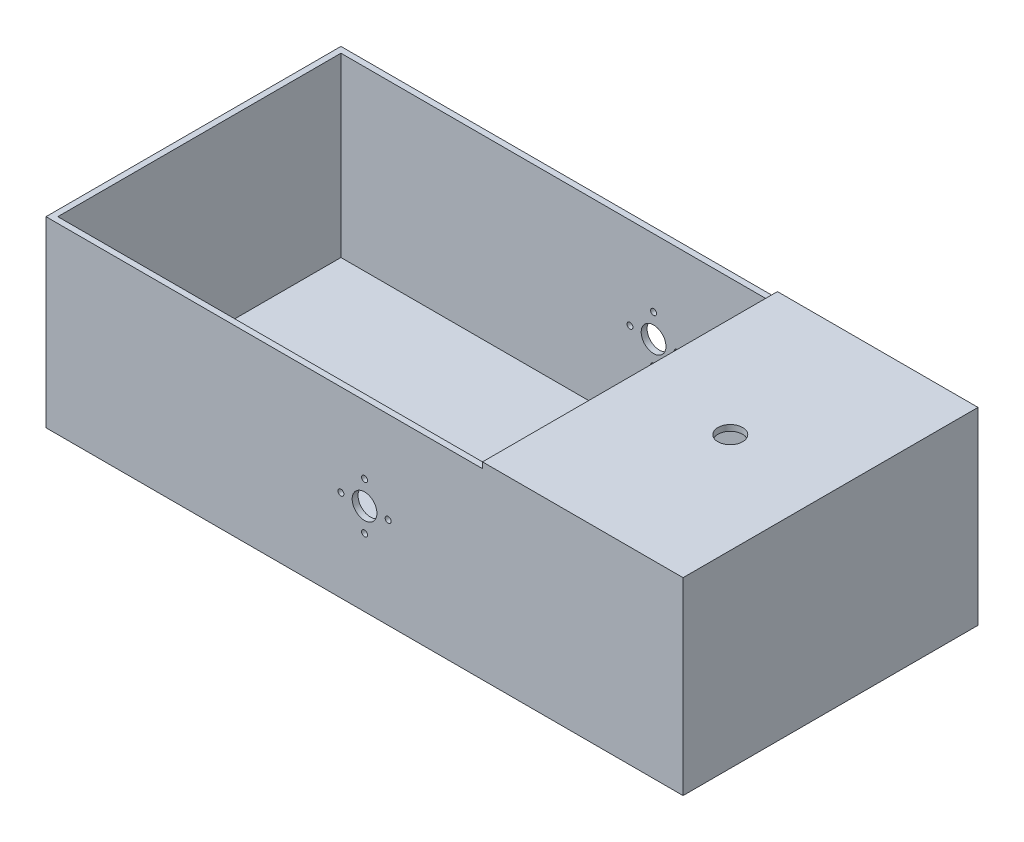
ISO-10303-21;
HEADER;
FILE_DESCRIPTION(('STEP AP214'),'2;1');
FILE_NAME('part.step','',(''),(''),'','','');
FILE_SCHEMA(('AUTOMOTIVE_DESIGN { 1 0 10303 214 1 1 1 1 }'));
ENDSEC;
DATA;
#1=APPLICATION_CONTEXT('core data for automotive mechanical design processes');
#2=APPLICATION_PROTOCOL_DEFINITION('international standard','automotive_design',2000,#1);
#3=PRODUCT_CONTEXT('',#1,'mechanical');
#4=PRODUCT('Part','Part','',(#3));
#5=PRODUCT_RELATED_PRODUCT_CATEGORY('part','',(#4));
#6=PRODUCT_DEFINITION_FORMATION('','',#4);
#7=PRODUCT_DEFINITION_CONTEXT('part definition',#1,'design');
#8=PRODUCT_DEFINITION('design','',#6,#7);
#9=PRODUCT_DEFINITION_SHAPE('','',#8);
#10=(LENGTH_UNIT() NAMED_UNIT(*) SI_UNIT(.MILLI.,.METRE.));
#11=(NAMED_UNIT(*) PLANE_ANGLE_UNIT() SI_UNIT($,.RADIAN.));
#12=(NAMED_UNIT(*) SI_UNIT($,.STERADIAN.) SOLID_ANGLE_UNIT());
#13=UNCERTAINTY_MEASURE_WITH_UNIT(LENGTH_MEASURE(1.E-05),#10,'distance_accuracy_value','');
#14=(GEOMETRIC_REPRESENTATION_CONTEXT(3) GLOBAL_UNCERTAINTY_ASSIGNED_CONTEXT((#13)) GLOBAL_UNIT_ASSIGNED_CONTEXT((#10,
#11,#12)) REPRESENTATION_CONTEXT('',''));
#15=CARTESIAN_POINT('',(0.,0.,0.));
#16=DIRECTION('',(0.,0.,1.));
#17=DIRECTION('',(1.,0.,0.));
#18=AXIS2_PLACEMENT_3D('',#15,#16,#17);
#19=CARTESIAN_POINT('',(-270.,5.,125.));
#20=DIRECTION('',(1.,0.,0.));
#21=DIRECTION('',(0.,0.,-1.));
#22=AXIS2_PLACEMENT_3D('',#19,#20,#21);
#23=PLANE('',#22);
#24=DIRECTION('',(0.,0.,1.));
#25=VECTOR('',#24,1.);
#26=CARTESIAN_POINT('',(-270.,0.,125.));
#27=LINE('',#26,#25);
#28=CARTESIAN_POINT('',(-270.,0.,-125.));
#29=VERTEX_POINT('',#28);
#30=CARTESIAN_POINT('',(-270.,0.,125.));
#31=VERTEX_POINT('',#30);
#32=EDGE_CURVE('E227',#29,#31,#27,.T.);
#33=ORIENTED_EDGE('',*,*,#32,.T.);
#34=DIRECTION('',(0.,-1.,0.));
#35=VECTOR('',#34,1.);
#36=CARTESIAN_POINT('',(-270.,5.,125.));
#37=LINE('',#36,#35);
#38=CARTESIAN_POINT('',(-270.,155.,125.));
#39=VERTEX_POINT('',#38);
#40=EDGE_CURVE('E52',#39,#31,#37,.T.);
#41=ORIENTED_EDGE('',*,*,#40,.F.);
#42=DIRECTION('',(0.,0.,1.));
#43=VECTOR('',#42,1.);
#44=CARTESIAN_POINT('',(-270.,155.,-125.));
#45=LINE('',#44,#43);
#46=CARTESIAN_POINT('',(-270.,155.,-125.));
#47=VERTEX_POINT('',#46);
#48=EDGE_CURVE('E223',#47,#39,#45,.T.);
#49=ORIENTED_EDGE('',*,*,#48,.F.);
#50=DIRECTION('',(0.,-1.,0.));
#51=VECTOR('',#50,1.);
#52=CARTESIAN_POINT('',(-270.,5.,-125.));
#53=LINE('',#52,#51);
#54=EDGE_CURVE('E140',#47,#29,#53,.T.);
#55=ORIENTED_EDGE('',*,*,#54,.T.);
#56=EDGE_LOOP('',(#33,#41,#49,#55));
#57=FACE_BOUND('',#56,.T.);
#58=ADVANCED_FACE('F43',(#57),#23,.F.);
#59=CARTESIAN_POINT('',(270.,5.,125.));
#60=DIRECTION('',(0.,0.,-1.));
#61=DIRECTION('',(-1.,0.,0.));
#62=AXIS2_PLACEMENT_3D('',#59,#60,#61);
#63=PLANE('',#62);
#64=CARTESIAN_POINT('',(0.,97.5,125.));
#65=DIRECTION('',(0.,0.,1.));
#66=DIRECTION('',(1.,0.,0.));
#67=AXIS2_PLACEMENT_3D('',#64,#65,#66);
#68=CIRCLE('',#67,2.5);
#69=CARTESIAN_POINT('',(2.5,97.5,125.));
#70=VERTEX_POINT('',#69);
#71=EDGE_CURVE('E626',#70,#70,#68,.T.);
#72=ORIENTED_EDGE('',*,*,#71,.F.);
#73=EDGE_LOOP('',(#72));
#74=FACE_BOUND('',#73,.T.);
#75=CARTESIAN_POINT('',(20.,77.5,125.));
#76=DIRECTION('',(0.,0.,1.));
#77=DIRECTION('',(1.,0.,0.));
#78=AXIS2_PLACEMENT_3D('',#75,#76,#77);
#79=CIRCLE('',#78,2.5);
#80=CARTESIAN_POINT('',(22.5,77.5,125.));
#81=VERTEX_POINT('',#80);
#82=EDGE_CURVE('E627',#81,#81,#79,.T.);
#83=ORIENTED_EDGE('',*,*,#82,.F.);
#84=EDGE_LOOP('',(#83));
#85=FACE_BOUND('',#84,.T.);
#86=CARTESIAN_POINT('',(-20.,77.5,125.));
#87=DIRECTION('',(0.,0.,1.));
#88=DIRECTION('',(1.,0.,0.));
#89=AXIS2_PLACEMENT_3D('',#86,#87,#88);
#90=CIRCLE('',#89,2.5);
#91=CARTESIAN_POINT('',(-17.5,77.5,125.));
#92=VERTEX_POINT('',#91);
#93=EDGE_CURVE('E642',#92,#92,#90,.T.);
#94=ORIENTED_EDGE('',*,*,#93,.F.);
#95=EDGE_LOOP('',(#94));
#96=FACE_BOUND('',#95,.T.);
#97=CARTESIAN_POINT('',(0.,57.5,125.));
#98=DIRECTION('',(0.,0.,1.));
#99=DIRECTION('',(1.,0.,0.));
#100=AXIS2_PLACEMENT_3D('',#97,#98,#99);
#101=CIRCLE('',#100,2.5);
#102=CARTESIAN_POINT('',(2.5,57.5,125.));
#103=VERTEX_POINT('',#102);
#104=EDGE_CURVE('E665',#103,#103,#101,.T.);
#105=ORIENTED_EDGE('',*,*,#104,.F.);
#106=EDGE_LOOP('',(#105));
#107=FACE_BOUND('',#106,.T.);
#108=CARTESIAN_POINT('',(0.,77.5,125.));
#109=DIRECTION('',(0.,0.,1.));
#110=DIRECTION('',(1.,0.,0.));
#111=AXIS2_PLACEMENT_3D('',#108,#109,#110);
#112=CIRCLE('',#111,10.5);
#113=CARTESIAN_POINT('',(10.5,77.5,125.));
#114=VERTEX_POINT('',#113);
#115=EDGE_CURVE('E632',#114,#114,#112,.T.);
#116=ORIENTED_EDGE('',*,*,#115,.F.);
#117=EDGE_LOOP('',(#116));
#118=FACE_BOUND('',#117,.T.);
#119=DIRECTION('',(1.,0.,0.));
#120=VECTOR('',#119,1.);
#121=CARTESIAN_POINT('',(270.,0.,125.));
#122=LINE('',#121,#120);
#123=CARTESIAN_POINT('',(270.,0.,125.));
#124=VERTEX_POINT('',#123);
#125=EDGE_CURVE('E231',#31,#124,#122,.T.);
#126=ORIENTED_EDGE('',*,*,#125,.T.);
#127=DIRECTION('',(0.,-1.,0.));
#128=VECTOR('',#127,1.);
#129=CARTESIAN_POINT('',(270.,5.,125.));
#130=LINE('',#129,#128);
#131=CARTESIAN_POINT('',(270.,160.,125.));
#132=VERTEX_POINT('',#131);
#133=EDGE_CURVE('E139',#132,#124,#130,.T.);
#134=ORIENTED_EDGE('',*,*,#133,.F.);
#135=DIRECTION('',(1.,0.,0.));
#136=VECTOR('',#135,1.);
#137=CARTESIAN_POINT('',(270.,160.,125.));
#138=LINE('',#137,#136);
#139=CARTESIAN_POINT('',(100.,160.,125.));
#140=VERTEX_POINT('',#139);
#141=EDGE_CURVE('E156',#140,#132,#138,.T.);
#142=ORIENTED_EDGE('',*,*,#141,.F.);
#143=DIRECTION('',(0.,-1.,0.));
#144=VECTOR('',#143,1.);
#145=CARTESIAN_POINT('',(100.,160.,125.));
#146=LINE('',#145,#144);
#147=CARTESIAN_POINT('',(100.,155.,125.));
#148=VERTEX_POINT('',#147);
#149=EDGE_CURVE('E168',#140,#148,#146,.T.);
#150=ORIENTED_EDGE('',*,*,#149,.T.);
#151=DIRECTION('',(1.,0.,0.));
#152=VECTOR('',#151,1.);
#153=CARTESIAN_POINT('',(-270.,155.,125.));
#154=LINE('',#153,#152);
#155=EDGE_CURVE('E217',#39,#148,#154,.T.);
#156=ORIENTED_EDGE('',*,*,#155,.F.);
#157=ORIENTED_EDGE('',*,*,#40,.T.);
#158=EDGE_LOOP('',(#126,#134,#142,#150,#156,#157));
#159=FACE_BOUND('',#158,.T.);
#160=ADVANCED_FACE('F333',(#74,#85,#96,#107,#118,#159),#63,.F.);
#161=CARTESIAN_POINT('',(270.,5.,125.));
#162=DIRECTION('',(-1.,0.,0.));
#163=DIRECTION('',(0.,0.,1.));
#164=AXIS2_PLACEMENT_3D('',#161,#162,#163);
#165=PLANE('',#164);
#166=DIRECTION('',(0.,0.,-1.));
#167=VECTOR('',#166,1.);
#168=CARTESIAN_POINT('',(270.,0.,125.));
#169=LINE('',#168,#167);
#170=CARTESIAN_POINT('',(270.,0.,-125.));
#171=VERTEX_POINT('',#170);
#172=EDGE_CURVE('E135',#124,#171,#169,.T.);
#173=ORIENTED_EDGE('',*,*,#172,.T.);
#174=DIRECTION('',(0.,-1.,0.));
#175=VECTOR('',#174,1.);
#176=CARTESIAN_POINT('',(270.,5.,-125.));
#177=LINE('',#176,#175);
#178=CARTESIAN_POINT('',(270.,160.,-125.));
#179=VERTEX_POINT('',#178);
#180=EDGE_CURVE('E128',#179,#171,#177,.T.);
#181=ORIENTED_EDGE('',*,*,#180,.F.);
#182=DIRECTION('',(0.,0.,-1.));
#183=VECTOR('',#182,1.);
#184=CARTESIAN_POINT('',(270.,160.,-125.));
#185=LINE('',#184,#183);
#186=EDGE_CURVE('E133',#132,#179,#185,.T.);
#187=ORIENTED_EDGE('',*,*,#186,.F.);
#188=ORIENTED_EDGE('',*,*,#133,.T.);
#189=EDGE_LOOP('',(#173,#181,#187,#188));
#190=FACE_BOUND('',#189,.T.);
#191=ADVANCED_FACE('F130',(#190),#165,.F.);
#192=CARTESIAN_POINT('',(270.,5.,-125.));
#193=DIRECTION('',(0.,0.,1.));
#194=DIRECTION('',(1.,0.,0.));
#195=AXIS2_PLACEMENT_3D('',#192,#193,#194);
#196=PLANE('',#195);
#197=CARTESIAN_POINT('',(0.,97.5,-125.));
#198=DIRECTION('',(0.,0.,1.));
#199=DIRECTION('',(1.,0.,0.));
#200=AXIS2_PLACEMENT_3D('',#197,#198,#199);
#201=CIRCLE('',#200,2.5);
#202=CARTESIAN_POINT('',(2.5,97.5,-125.));
#203=VERTEX_POINT('',#202);
#204=EDGE_CURVE('E624',#203,#203,#201,.T.);
#205=ORIENTED_EDGE('',*,*,#204,.T.);
#206=EDGE_LOOP('',(#205));
#207=FACE_BOUND('',#206,.T.);
#208=CARTESIAN_POINT('',(20.,77.5,-125.));
#209=DIRECTION('',(0.,0.,1.));
#210=DIRECTION('',(1.,0.,0.));
#211=AXIS2_PLACEMENT_3D('',#208,#209,#210);
#212=CIRCLE('',#211,2.5);
#213=CARTESIAN_POINT('',(22.5,77.5,-125.));
#214=VERTEX_POINT('',#213);
#215=EDGE_CURVE('E635',#214,#214,#212,.T.);
#216=ORIENTED_EDGE('',*,*,#215,.T.);
#217=EDGE_LOOP('',(#216));
#218=FACE_BOUND('',#217,.T.);
#219=CARTESIAN_POINT('',(-20.,77.5,-125.));
#220=DIRECTION('',(0.,0.,1.));
#221=DIRECTION('',(1.,0.,0.));
#222=AXIS2_PLACEMENT_3D('',#219,#220,#221);
#223=CIRCLE('',#222,2.5);
#224=CARTESIAN_POINT('',(-17.5,77.5,-125.));
#225=VERTEX_POINT('',#224);
#226=EDGE_CURVE('E668',#225,#225,#223,.T.);
#227=ORIENTED_EDGE('',*,*,#226,.T.);
#228=EDGE_LOOP('',(#227));
#229=FACE_BOUND('',#228,.T.);
#230=CARTESIAN_POINT('',(0.,57.5,-125.));
#231=DIRECTION('',(0.,0.,1.));
#232=DIRECTION('',(1.,0.,0.));
#233=AXIS2_PLACEMENT_3D('',#230,#231,#232);
#234=CIRCLE('',#233,2.5);
#235=CARTESIAN_POINT('',(2.5,57.5,-125.));
#236=VERTEX_POINT('',#235);
#237=EDGE_CURVE('E662',#236,#236,#234,.T.);
#238=ORIENTED_EDGE('',*,*,#237,.T.);
#239=EDGE_LOOP('',(#238));
#240=FACE_BOUND('',#239,.T.);
#241=CARTESIAN_POINT('',(0.,77.5,-125.));
#242=DIRECTION('',(0.,0.,1.));
#243=DIRECTION('',(1.,0.,0.));
#244=AXIS2_PLACEMENT_3D('',#241,#242,#243);
#245=CIRCLE('',#244,10.5);
#246=CARTESIAN_POINT('',(10.5,77.5,-125.));
#247=VERTEX_POINT('',#246);
#248=EDGE_CURVE('E252',#247,#247,#245,.T.);
#249=ORIENTED_EDGE('',*,*,#248,.T.);
#250=EDGE_LOOP('',(#249));
#251=FACE_BOUND('',#250,.T.);
#252=DIRECTION('',(-1.,0.,0.));
#253=VECTOR('',#252,1.);
#254=CARTESIAN_POINT('',(270.,0.,-125.));
#255=LINE('',#254,#253);
#256=EDGE_CURVE('E236',#171,#29,#255,.T.);
#257=ORIENTED_EDGE('',*,*,#256,.T.);
#258=ORIENTED_EDGE('',*,*,#54,.F.);
#259=DIRECTION('',(-1.,0.,0.));
#260=VECTOR('',#259,1.);
#261=CARTESIAN_POINT('',(270.,155.,-125.));
#262=LINE('',#261,#260);
#263=CARTESIAN_POINT('',(100.,155.,-125.));
#264=VERTEX_POINT('',#263);
#265=EDGE_CURVE('E220',#264,#47,#262,.T.);
#266=ORIENTED_EDGE('',*,*,#265,.F.);
#267=DIRECTION('',(0.,-1.,0.));
#268=VECTOR('',#267,1.);
#269=CARTESIAN_POINT('',(100.,160.,-125.));
#270=LINE('',#269,#268);
#271=CARTESIAN_POINT('',(100.,160.,-125.));
#272=VERTEX_POINT('',#271);
#273=EDGE_CURVE('E147',#272,#264,#270,.T.);
#274=ORIENTED_EDGE('',*,*,#273,.F.);
#275=DIRECTION('',(-1.,0.,0.));
#276=VECTOR('',#275,1.);
#277=CARTESIAN_POINT('',(270.,160.,-125.));
#278=LINE('',#277,#276);
#279=EDGE_CURVE('E143',#179,#272,#278,.T.);
#280=ORIENTED_EDGE('',*,*,#279,.F.);
#281=ORIENTED_EDGE('',*,*,#180,.T.);
#282=EDGE_LOOP('',(#257,#258,#266,#274,#280,#281));
#283=FACE_BOUND('',#282,.T.);
#284=ADVANCED_FACE('F144',(#207,#218,#229,#240,#251,#283),#196,.F.);
#285=CARTESIAN_POINT('',(0.,0.,0.));
#286=DIRECTION('',(0.,1.,0.));
#287=DIRECTION('',(0.,0.,1.));
#288=AXIS2_PLACEMENT_3D('',#285,#286,#287);
#289=PLANE('',#288);
#290=ORIENTED_EDGE('',*,*,#32,.F.);
#291=ORIENTED_EDGE('',*,*,#256,.F.);
#292=ORIENTED_EDGE('',*,*,#172,.F.);
#293=ORIENTED_EDGE('',*,*,#125,.F.);
#294=EDGE_LOOP('',(#290,#291,#292,#293));
#295=FACE_BOUND('',#294,.T.);
#296=ADVANCED_FACE('F330',(#295),#289,.F.);
#297=CARTESIAN_POINT('',(0.,155.,0.));
#298=DIRECTION('',(0.,1.,0.));
#299=DIRECTION('',(0.,0.,1.));
#300=AXIS2_PLACEMENT_3D('',#297,#298,#299);
#301=PLANE('',#300);
#302=DIRECTION('',(0.,0.,1.));
#303=VECTOR('',#302,1.);
#304=CARTESIAN_POINT('',(100.,155.,-125.));
#305=LINE('',#304,#303);
#306=CARTESIAN_POINT('',(100.,155.,-120.));
#307=VERTEX_POINT('',#306);
#308=EDGE_CURVE('E54',#264,#307,#305,.T.);
#309=ORIENTED_EDGE('',*,*,#308,.F.);
#310=ORIENTED_EDGE('',*,*,#265,.T.);
#311=ORIENTED_EDGE('',*,*,#48,.T.);
#312=ORIENTED_EDGE('',*,*,#155,.T.);
#313=CARTESIAN_POINT('',(100.,155.,120.));
#314=VERTEX_POINT('',#313);
#315=EDGE_CURVE('E11',#314,#148,#305,.T.);
#316=ORIENTED_EDGE('',*,*,#315,.F.);
#317=DIRECTION('',(1.,0.,0.));
#318=VECTOR('',#317,1.);
#319=CARTESIAN_POINT('',(-265.,155.,120.));
#320=LINE('',#319,#318);
#321=CARTESIAN_POINT('',(-265.,155.,120.));
#322=VERTEX_POINT('',#321);
#323=EDGE_CURVE('E188',#322,#314,#320,.T.);
#324=ORIENTED_EDGE('',*,*,#323,.F.);
#325=DIRECTION('',(0.,0.,1.));
#326=VECTOR('',#325,1.);
#327=CARTESIAN_POINT('',(-265.,155.,-120.));
#328=LINE('',#327,#326);
#329=CARTESIAN_POINT('',(-265.,155.,-120.));
#330=VERTEX_POINT('',#329);
#331=EDGE_CURVE('E183',#330,#322,#328,.T.);
#332=ORIENTED_EDGE('',*,*,#331,.F.);
#333=DIRECTION('',(-1.,0.,0.));
#334=VECTOR('',#333,1.);
#335=CARTESIAN_POINT('',(265.,155.,-120.));
#336=LINE('',#335,#334);
#337=EDGE_CURVE('E67',#307,#330,#336,.T.);
#338=ORIENTED_EDGE('',*,*,#337,.F.);
#339=EDGE_LOOP('',(#309,#310,#311,#312,#316,#324,#332,#338));
#340=FACE_BOUND('',#339,.T.);
#341=ADVANCED_FACE('F314',(#340),#301,.T.);
#342=CARTESIAN_POINT('',(265.,155.,120.));
#343=DIRECTION('',(-1.,0.,0.));
#344=DIRECTION('',(0.,0.,1.));
#345=AXIS2_PLACEMENT_3D('',#342,#343,#344);
#346=PLANE('',#345);
#347=DIRECTION('',(0.,0.,-1.));
#348=VECTOR('',#347,1.);
#349=CARTESIAN_POINT('',(265.,5.,120.));
#350=LINE('',#349,#348);
#351=CARTESIAN_POINT('',(265.,5.,120.));
#352=VERTEX_POINT('',#351);
#353=CARTESIAN_POINT('',(265.,5.,-120.));
#354=VERTEX_POINT('',#353);
#355=EDGE_CURVE('E175',#352,#354,#350,.T.);
#356=ORIENTED_EDGE('',*,*,#355,.F.);
#357=DIRECTION('',(0.,-1.,0.));
#358=VECTOR('',#357,1.);
#359=CARTESIAN_POINT('',(265.,155.,120.));
#360=LINE('',#359,#358);
#361=CARTESIAN_POINT('',(265.,155.,120.));
#362=VERTEX_POINT('',#361);
#363=EDGE_CURVE('E191',#362,#352,#360,.T.);
#364=ORIENTED_EDGE('',*,*,#363,.F.);
#365=DIRECTION('',(0.,0.,-1.));
#366=VECTOR('',#365,1.);
#367=CARTESIAN_POINT('',(265.,155.,120.));
#368=LINE('',#367,#366);
#369=CARTESIAN_POINT('',(265.,155.,-120.));
#370=VERTEX_POINT('',#369);
#371=EDGE_CURVE('E176',#362,#370,#368,.T.);
#372=ORIENTED_EDGE('',*,*,#371,.T.);
#373=DIRECTION('',(0.,-1.,0.));
#374=VECTOR('',#373,1.);
#375=CARTESIAN_POINT('',(265.,155.,-120.));
#376=LINE('',#375,#374);
#377=EDGE_CURVE('E213',#370,#354,#376,.T.);
#378=ORIENTED_EDGE('',*,*,#377,.T.);
#379=EDGE_LOOP('',(#356,#364,#372,#378));
#380=FACE_BOUND('',#379,.T.);
#381=ADVANCED_FACE('F321',(#380),#346,.T.);
#382=CARTESIAN_POINT('',(265.,155.,-120.));
#383=DIRECTION('',(0.,0.,1.));
#384=DIRECTION('',(1.,0.,0.));
#385=AXIS2_PLACEMENT_3D('',#382,#383,#384);
#386=PLANE('',#385);
#387=CARTESIAN_POINT('',(0.,97.5,-120.));
#388=DIRECTION('',(0.,0.,1.));
#389=DIRECTION('',(1.,0.,0.));
#390=AXIS2_PLACEMENT_3D('',#387,#388,#389);
#391=CIRCLE('',#390,2.5);
#392=CARTESIAN_POINT('',(2.5,97.5,-120.));
#393=VERTEX_POINT('',#392);
#394=EDGE_CURVE('E279',#393,#393,#391,.T.);
#395=ORIENTED_EDGE('',*,*,#394,.F.);
#396=EDGE_LOOP('',(#395));
#397=FACE_BOUND('',#396,.T.);
#398=CARTESIAN_POINT('',(20.,77.5,-120.));
#399=DIRECTION('',(0.,0.,1.));
#400=DIRECTION('',(1.,0.,0.));
#401=AXIS2_PLACEMENT_3D('',#398,#399,#400);
#402=CIRCLE('',#401,2.5);
#403=CARTESIAN_POINT('',(22.5,77.5,-120.));
#404=VERTEX_POINT('',#403);
#405=EDGE_CURVE('E265',#404,#404,#402,.T.);
#406=ORIENTED_EDGE('',*,*,#405,.F.);
#407=EDGE_LOOP('',(#406));
#408=FACE_BOUND('',#407,.T.);
#409=CARTESIAN_POINT('',(-20.,77.5,-120.));
#410=DIRECTION('',(0.,0.,1.));
#411=DIRECTION('',(1.,0.,0.));
#412=AXIS2_PLACEMENT_3D('',#409,#410,#411);
#413=CIRCLE('',#412,2.5);
#414=CARTESIAN_POINT('',(-17.5,77.5,-120.));
#415=VERTEX_POINT('',#414);
#416=EDGE_CURVE('E261',#415,#415,#413,.T.);
#417=ORIENTED_EDGE('',*,*,#416,.F.);
#418=EDGE_LOOP('',(#417));
#419=FACE_BOUND('',#418,.T.);
#420=CARTESIAN_POINT('',(0.,57.5,-120.));
#421=DIRECTION('',(0.,0.,1.));
#422=DIRECTION('',(1.,0.,0.));
#423=AXIS2_PLACEMENT_3D('',#420,#421,#422);
#424=CIRCLE('',#423,2.5);
#425=CARTESIAN_POINT('',(2.5,57.5,-120.));
#426=VERTEX_POINT('',#425);
#427=EDGE_CURVE('E257',#426,#426,#424,.T.);
#428=ORIENTED_EDGE('',*,*,#427,.F.);
#429=EDGE_LOOP('',(#428));
#430=FACE_BOUND('',#429,.T.);
#431=CARTESIAN_POINT('',(0.,77.5,-120.));
#432=DIRECTION('',(0.,0.,1.));
#433=DIRECTION('',(1.,0.,0.));
#434=AXIS2_PLACEMENT_3D('',#431,#432,#433);
#435=CIRCLE('',#434,10.5);
#436=CARTESIAN_POINT('',(10.5,77.5,-120.));
#437=VERTEX_POINT('',#436);
#438=EDGE_CURVE('E251',#437,#437,#435,.T.);
#439=ORIENTED_EDGE('',*,*,#438,.F.);
#440=EDGE_LOOP('',(#439));
#441=FACE_BOUND('',#440,.T.);
#442=DIRECTION('',(-1.,0.,0.));
#443=VECTOR('',#442,1.);
#444=CARTESIAN_POINT('',(265.,5.,-120.));
#445=LINE('',#444,#443);
#446=CARTESIAN_POINT('',(-265.,5.,-120.));
#447=VERTEX_POINT('',#446);
#448=EDGE_CURVE('E194',#354,#447,#445,.T.);
#449=ORIENTED_EDGE('',*,*,#448,.F.);
#450=ORIENTED_EDGE('',*,*,#377,.F.);
#451=EDGE_CURVE('E180',#370,#307,#336,.T.);
#452=ORIENTED_EDGE('',*,*,#451,.T.);
#453=ORIENTED_EDGE('',*,*,#337,.T.);
#454=DIRECTION('',(0.,-1.,0.));
#455=VECTOR('',#454,1.);
#456=CARTESIAN_POINT('',(-265.,155.,-120.));
#457=LINE('',#456,#455);
#458=EDGE_CURVE('E209',#330,#447,#457,.T.);
#459=ORIENTED_EDGE('',*,*,#458,.T.);
#460=EDGE_LOOP('',(#449,#450,#452,#453,#459));
#461=FACE_BOUND('',#460,.T.);
#462=ADVANCED_FACE('F309',(#397,#408,#419,#430,#441,#461),#386,.T.);
#463=CARTESIAN_POINT('',(-265.,155.,-120.));
#464=DIRECTION('',(1.,0.,0.));
#465=DIRECTION('',(0.,0.,-1.));
#466=AXIS2_PLACEMENT_3D('',#463,#464,#465);
#467=PLANE('',#466);
#468=DIRECTION('',(0.,0.,1.));
#469=VECTOR('',#468,1.);
#470=CARTESIAN_POINT('',(-265.,5.,-120.));
#471=LINE('',#470,#469);
#472=CARTESIAN_POINT('',(-265.,5.,120.));
#473=VERTEX_POINT('',#472);
#474=EDGE_CURVE('E197',#447,#473,#471,.T.);
#475=ORIENTED_EDGE('',*,*,#474,.F.);
#476=ORIENTED_EDGE('',*,*,#458,.F.);
#477=ORIENTED_EDGE('',*,*,#331,.T.);
#478=DIRECTION('',(0.,-1.,0.));
#479=VECTOR('',#478,1.);
#480=CARTESIAN_POINT('',(-265.,155.,120.));
#481=LINE('',#480,#479);
#482=EDGE_CURVE('E205',#322,#473,#481,.T.);
#483=ORIENTED_EDGE('',*,*,#482,.T.);
#484=EDGE_LOOP('',(#475,#476,#477,#483));
#485=FACE_BOUND('',#484,.T.);
#486=ADVANCED_FACE('F313',(#485),#467,.T.);
#487=CARTESIAN_POINT('',(-265.,155.,120.));
#488=DIRECTION('',(0.,0.,-1.));
#489=DIRECTION('',(-1.,0.,0.));
#490=AXIS2_PLACEMENT_3D('',#487,#488,#489);
#491=PLANE('',#490);
#492=CARTESIAN_POINT('',(0.,97.5,120.));
#493=DIRECTION('',(0.,0.,-1.));
#494=DIRECTION('',(-1.,0.,0.));
#495=AXIS2_PLACEMENT_3D('',#492,#493,#494);
#496=CIRCLE('',#495,2.5);
#497=CARTESIAN_POINT('',(-2.5,97.5,120.));
#498=VERTEX_POINT('',#497);
#499=EDGE_CURVE('E46',#498,#498,#496,.T.);
#500=ORIENTED_EDGE('',*,*,#499,.F.);
#501=EDGE_LOOP('',(#500));
#502=FACE_BOUND('',#501,.T.);
#503=CARTESIAN_POINT('',(20.,77.5,120.));
#504=DIRECTION('',(0.,0.,-1.));
#505=DIRECTION('',(-1.,0.,0.));
#506=AXIS2_PLACEMENT_3D('',#503,#504,#505);
#507=CIRCLE('',#506,2.5);
#508=CARTESIAN_POINT('',(17.5,77.5,120.));
#509=VERTEX_POINT('',#508);
#510=EDGE_CURVE('E262',#509,#509,#507,.T.);
#511=ORIENTED_EDGE('',*,*,#510,.F.);
#512=EDGE_LOOP('',(#511));
#513=FACE_BOUND('',#512,.T.);
#514=CARTESIAN_POINT('',(-20.,77.5,120.));
#515=DIRECTION('',(0.,0.,-1.));
#516=DIRECTION('',(-1.,0.,0.));
#517=AXIS2_PLACEMENT_3D('',#514,#515,#516);
#518=CIRCLE('',#517,2.5);
#519=CARTESIAN_POINT('',(-22.5,77.5,120.));
#520=VERTEX_POINT('',#519);
#521=EDGE_CURVE('E258',#520,#520,#518,.T.);
#522=ORIENTED_EDGE('',*,*,#521,.F.);
#523=EDGE_LOOP('',(#522));
#524=FACE_BOUND('',#523,.T.);
#525=CARTESIAN_POINT('',(0.,57.5,120.));
#526=DIRECTION('',(0.,0.,-1.));
#527=DIRECTION('',(-1.,0.,0.));
#528=AXIS2_PLACEMENT_3D('',#525,#526,#527);
#529=CIRCLE('',#528,2.5);
#530=CARTESIAN_POINT('',(-2.5,57.5,120.));
#531=VERTEX_POINT('',#530);
#532=EDGE_CURVE('E253',#531,#531,#529,.T.);
#533=ORIENTED_EDGE('',*,*,#532,.F.);
#534=EDGE_LOOP('',(#533));
#535=FACE_BOUND('',#534,.T.);
#536=CARTESIAN_POINT('',(0.,77.5,120.));
#537=DIRECTION('',(0.,0.,-1.));
#538=DIRECTION('',(-1.,0.,0.));
#539=AXIS2_PLACEMENT_3D('',#536,#537,#538);
#540=CIRCLE('',#539,10.5);
#541=CARTESIAN_POINT('',(-10.5,77.5,120.));
#542=VERTEX_POINT('',#541);
#543=EDGE_CURVE('E247',#542,#542,#540,.T.);
#544=ORIENTED_EDGE('',*,*,#543,.F.);
#545=EDGE_LOOP('',(#544));
#546=FACE_BOUND('',#545,.T.);
#547=DIRECTION('',(1.,0.,0.));
#548=VECTOR('',#547,1.);
#549=CARTESIAN_POINT('',(-265.,5.,120.));
#550=LINE('',#549,#548);
#551=EDGE_CURVE('E179',#473,#352,#550,.T.);
#552=ORIENTED_EDGE('',*,*,#551,.F.);
#553=ORIENTED_EDGE('',*,*,#482,.F.);
#554=ORIENTED_EDGE('',*,*,#323,.T.);
#555=EDGE_CURVE('E187',#314,#362,#320,.T.);
#556=ORIENTED_EDGE('',*,*,#555,.T.);
#557=ORIENTED_EDGE('',*,*,#363,.T.);
#558=EDGE_LOOP('',(#552,#553,#554,#556,#557));
#559=FACE_BOUND('',#558,.T.);
#560=ADVANCED_FACE('F316',(#502,#513,#524,#535,#546,#559),#491,.T.);
#561=CARTESIAN_POINT('',(0.,5.,0.));
#562=DIRECTION('',(0.,1.,0.));
#563=DIRECTION('',(0.,0.,1.));
#564=AXIS2_PLACEMENT_3D('',#561,#562,#563);
#565=PLANE('',#564);
#566=ORIENTED_EDGE('',*,*,#355,.T.);
#567=ORIENTED_EDGE('',*,*,#448,.T.);
#568=ORIENTED_EDGE('',*,*,#474,.T.);
#569=ORIENTED_EDGE('',*,*,#551,.T.);
#570=EDGE_LOOP('',(#566,#567,#568,#569));
#571=FACE_BOUND('',#570,.T.);
#572=ADVANCED_FACE('F319',(#571),#565,.T.);
#573=CARTESIAN_POINT('',(0.,155.,0.));
#574=DIRECTION('',(0.,-1.,0.));
#575=DIRECTION('',(0.,0.,-1.));
#576=AXIS2_PLACEMENT_3D('',#573,#574,#575);
#577=PLANE('',#576);
#578=CARTESIAN_POINT('',(185.,155.,0.));
#579=DIRECTION('',(0.,-1.,0.));
#580=DIRECTION('',(0.,0.,-1.));
#581=AXIS2_PLACEMENT_3D('',#578,#579,#580);
#582=CIRCLE('',#581,10.5);
#583=CARTESIAN_POINT('',(185.,155.,-10.5));
#584=VERTEX_POINT('',#583);
#585=EDGE_CURVE('E162',#584,#584,#582,.T.);
#586=ORIENTED_EDGE('',*,*,#585,.F.);
#587=EDGE_LOOP('',(#586));
#588=FACE_BOUND('',#587,.T.);
#589=ORIENTED_EDGE('',*,*,#451,.F.);
#590=ORIENTED_EDGE('',*,*,#371,.F.);
#591=ORIENTED_EDGE('',*,*,#555,.F.);
#592=EDGE_CURVE('E55',#307,#314,#305,.T.);
#593=ORIENTED_EDGE('',*,*,#592,.F.);
#594=EDGE_LOOP('',(#589,#590,#591,#593));
#595=FACE_BOUND('',#594,.T.);
#596=ADVANCED_FACE('F300',(#588,#595),#577,.T.);
#597=CARTESIAN_POINT('',(100.,160.,-125.));
#598=DIRECTION('',(1.,0.,0.));
#599=DIRECTION('',(0.,0.,-1.));
#600=AXIS2_PLACEMENT_3D('',#597,#598,#599);
#601=PLANE('',#600);
#602=ORIENTED_EDGE('',*,*,#308,.T.);
#603=ORIENTED_EDGE('',*,*,#592,.T.);
#604=ORIENTED_EDGE('',*,*,#315,.T.);
#605=ORIENTED_EDGE('',*,*,#149,.F.);
#606=DIRECTION('',(0.,0.,1.));
#607=VECTOR('',#606,1.);
#608=CARTESIAN_POINT('',(100.,160.,-125.));
#609=LINE('',#608,#607);
#610=EDGE_CURVE('E151',#272,#140,#609,.T.);
#611=ORIENTED_EDGE('',*,*,#610,.F.);
#612=ORIENTED_EDGE('',*,*,#273,.T.);
#613=EDGE_LOOP('',(#602,#603,#604,#605,#611,#612));
#614=FACE_BOUND('',#613,.T.);
#615=ADVANCED_FACE('F295',(#614),#601,.F.);
#616=CARTESIAN_POINT('',(0.,160.,0.));
#617=DIRECTION('',(0.,-1.,0.));
#618=DIRECTION('',(0.,0.,-1.));
#619=AXIS2_PLACEMENT_3D('',#616,#617,#618);
#620=PLANE('',#619);
#621=CARTESIAN_POINT('',(185.,160.,0.));
#622=DIRECTION('',(0.,1.,0.));
#623=DIRECTION('',(0.,0.,1.));
#624=AXIS2_PLACEMENT_3D('',#621,#622,#623);
#625=CIRCLE('',#624,10.5);
#626=CARTESIAN_POINT('',(185.,160.,10.5));
#627=VERTEX_POINT('',#626);
#628=EDGE_CURVE('E282',#627,#627,#625,.T.);
#629=ORIENTED_EDGE('',*,*,#628,.F.);
#630=EDGE_LOOP('',(#629));
#631=FACE_BOUND('',#630,.T.);
#632=ORIENTED_EDGE('',*,*,#186,.T.);
#633=ORIENTED_EDGE('',*,*,#279,.T.);
#634=ORIENTED_EDGE('',*,*,#610,.T.);
#635=ORIENTED_EDGE('',*,*,#141,.T.);
#636=EDGE_LOOP('',(#632,#633,#634,#635));
#637=FACE_BOUND('',#636,.T.);
#638=ADVANCED_FACE('F154',(#631,#637),#620,.F.);
#639=CARTESIAN_POINT('',(185.,150.,0.));
#640=DIRECTION('',(0.,1.,0.));
#641=DIRECTION('',(0.,0.,1.));
#642=AXIS2_PLACEMENT_3D('',#639,#640,#641);
#643=CYLINDRICAL_SURFACE('',#642,10.5);
#644=ORIENTED_EDGE('',*,*,#585,.T.);
#645=EDGE_LOOP('',(#644));
#646=FACE_BOUND('',#645,.T.);
#647=ORIENTED_EDGE('',*,*,#628,.T.);
#648=EDGE_LOOP('',(#647));
#649=FACE_BOUND('',#648,.T.);
#650=ADVANCED_FACE('F402',(#646,#649),#643,.F.);
#651=CARTESIAN_POINT('',(0.,77.5,-125.));
#652=DIRECTION('',(0.,0.,1.));
#653=DIRECTION('',(1.,0.,0.));
#654=AXIS2_PLACEMENT_3D('',#651,#652,#653);
#655=CYLINDRICAL_SURFACE('',#654,10.5);
#656=ORIENTED_EDGE('',*,*,#543,.T.);
#657=EDGE_LOOP('',(#656));
#658=FACE_BOUND('',#657,.T.);
#659=ORIENTED_EDGE('',*,*,#115,.T.);
#660=EDGE_LOOP('',(#659));
#661=FACE_BOUND('',#660,.T.);
#662=ADVANCED_FACE('F396',(#658,#661),#655,.F.);
#663=CARTESIAN_POINT('',(0.,57.5,-125.));
#664=DIRECTION('',(0.,0.,1.));
#665=DIRECTION('',(1.,0.,0.));
#666=AXIS2_PLACEMENT_3D('',#663,#664,#665);
#667=CYLINDRICAL_SURFACE('',#666,2.5);
#668=ORIENTED_EDGE('',*,*,#532,.T.);
#669=EDGE_LOOP('',(#668));
#670=FACE_BOUND('',#669,.T.);
#671=ORIENTED_EDGE('',*,*,#104,.T.);
#672=EDGE_LOOP('',(#671));
#673=FACE_BOUND('',#672,.T.);
#674=ADVANCED_FACE('F401',(#670,#673),#667,.F.);
#675=CARTESIAN_POINT('',(-20.,77.5,-125.));
#676=DIRECTION('',(0.,0.,1.));
#677=DIRECTION('',(1.,0.,0.));
#678=AXIS2_PLACEMENT_3D('',#675,#676,#677);
#679=CYLINDRICAL_SURFACE('',#678,2.5);
#680=ORIENTED_EDGE('',*,*,#521,.T.);
#681=EDGE_LOOP('',(#680));
#682=FACE_BOUND('',#681,.T.);
#683=ORIENTED_EDGE('',*,*,#93,.T.);
#684=EDGE_LOOP('',(#683));
#685=FACE_BOUND('',#684,.T.);
#686=ADVANCED_FACE('F416',(#682,#685),#679,.F.);
#687=CARTESIAN_POINT('',(20.,77.5,-125.));
#688=DIRECTION('',(0.,0.,1.));
#689=DIRECTION('',(1.,0.,0.));
#690=AXIS2_PLACEMENT_3D('',#687,#688,#689);
#691=CYLINDRICAL_SURFACE('',#690,2.5);
#692=ORIENTED_EDGE('',*,*,#510,.T.);
#693=EDGE_LOOP('',(#692));
#694=FACE_BOUND('',#693,.T.);
#695=ORIENTED_EDGE('',*,*,#82,.T.);
#696=EDGE_LOOP('',(#695));
#697=FACE_BOUND('',#696,.T.);
#698=ADVANCED_FACE('F428',(#694,#697),#691,.F.);
#699=CARTESIAN_POINT('',(0.,97.5,-125.));
#700=DIRECTION('',(0.,0.,1.));
#701=DIRECTION('',(1.,0.,0.));
#702=AXIS2_PLACEMENT_3D('',#699,#700,#701);
#703=CYLINDRICAL_SURFACE('',#702,2.5);
#704=ORIENTED_EDGE('',*,*,#499,.T.);
#705=EDGE_LOOP('',(#704));
#706=FACE_BOUND('',#705,.T.);
#707=ORIENTED_EDGE('',*,*,#71,.T.);
#708=EDGE_LOOP('',(#707));
#709=FACE_BOUND('',#708,.T.);
#710=ADVANCED_FACE('F440',(#706,#709),#703,.F.);
#711=ORIENTED_EDGE('',*,*,#438,.T.);
#712=EDGE_LOOP('',(#711));
#713=FACE_BOUND('',#712,.T.);
#714=ORIENTED_EDGE('',*,*,#248,.F.);
#715=EDGE_LOOP('',(#714));
#716=FACE_BOUND('',#715,.T.);
#717=ADVANCED_FACE('F405',(#713,#716),#655,.F.);
#718=ORIENTED_EDGE('',*,*,#427,.T.);
#719=EDGE_LOOP('',(#718));
#720=FACE_BOUND('',#719,.T.);
#721=ORIENTED_EDGE('',*,*,#237,.F.);
#722=EDGE_LOOP('',(#721));
#723=FACE_BOUND('',#722,.T.);
#724=ADVANCED_FACE('F419',(#720,#723),#667,.F.);
#725=ORIENTED_EDGE('',*,*,#416,.T.);
#726=EDGE_LOOP('',(#725));
#727=FACE_BOUND('',#726,.T.);
#728=ORIENTED_EDGE('',*,*,#226,.F.);
#729=EDGE_LOOP('',(#728));
#730=FACE_BOUND('',#729,.T.);
#731=ADVANCED_FACE('F431',(#727,#730),#679,.F.);
#732=ORIENTED_EDGE('',*,*,#405,.T.);
#733=EDGE_LOOP('',(#732));
#734=FACE_BOUND('',#733,.T.);
#735=ORIENTED_EDGE('',*,*,#215,.F.);
#736=EDGE_LOOP('',(#735));
#737=FACE_BOUND('',#736,.T.);
#738=ADVANCED_FACE('F442',(#734,#737),#691,.F.);
#739=ORIENTED_EDGE('',*,*,#394,.T.);
#740=EDGE_LOOP('',(#739));
#741=FACE_BOUND('',#740,.T.);
#742=ORIENTED_EDGE('',*,*,#204,.F.);
#743=EDGE_LOOP('',(#742));
#744=FACE_BOUND('',#743,.T.);
#745=ADVANCED_FACE('F453',(#741,#744),#703,.F.);
#746=CLOSED_SHELL('',(#58,#160,#191,#284,#296,#341,#381,#462,#486,#560,#572,#596,#615,#638,#650,
#662,#674,#686,#698,#710,#717,#724,#731,#738,#745));
#747=MANIFOLD_SOLID_BREP('B2',#746);
#748=ADVANCED_BREP_SHAPE_REPRESENTATION('',(#18,#747),#14);
#749=SHAPE_DEFINITION_REPRESENTATION(#9,#748);
ENDSEC;
END-ISO-10303-21;
